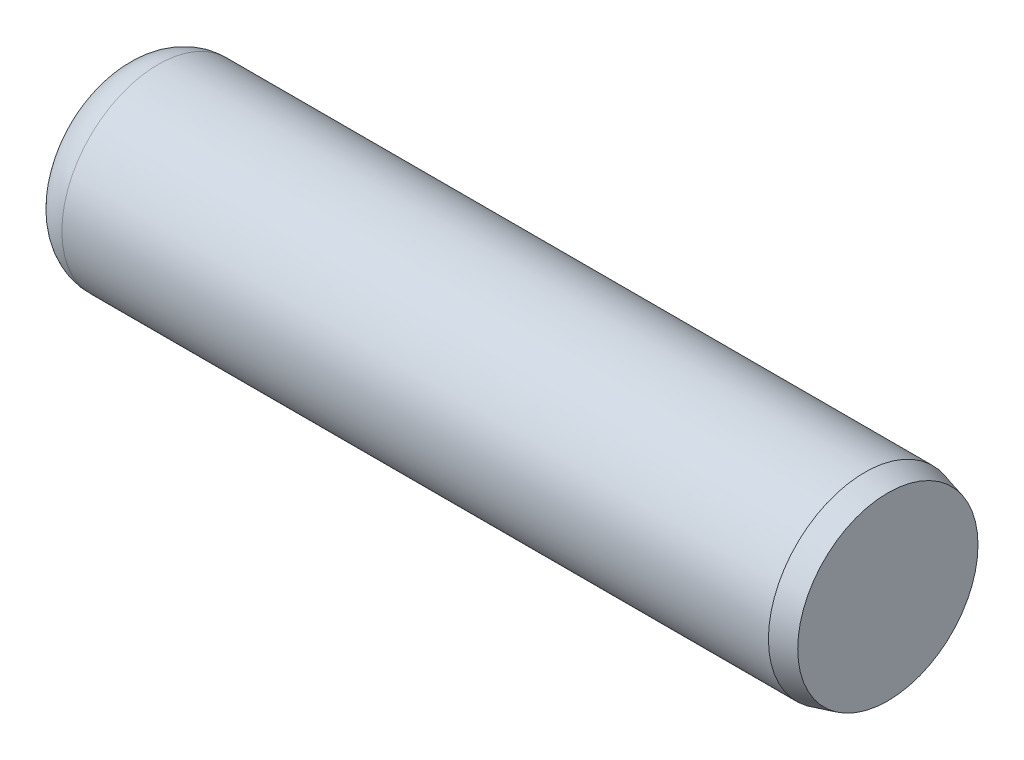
ISO-10303-21;
HEADER;
FILE_DESCRIPTION(('STEP AP214'),'2;1');
FILE_NAME('part.step','',(''),(''),'','','');
FILE_SCHEMA(('AUTOMOTIVE_DESIGN { 1 0 10303 214 1 1 1 1 }'));
ENDSEC;
DATA;
#1=APPLICATION_CONTEXT('core data for automotive mechanical design processes');
#2=APPLICATION_PROTOCOL_DEFINITION('international standard','automotive_design',2000,#1);
#3=PRODUCT_CONTEXT('',#1,'mechanical');
#4=PRODUCT('Part','Part','',(#3));
#5=PRODUCT_RELATED_PRODUCT_CATEGORY('part','',(#4));
#6=PRODUCT_DEFINITION_FORMATION('','',#4);
#7=PRODUCT_DEFINITION_CONTEXT('part definition',#1,'design');
#8=PRODUCT_DEFINITION('design','',#6,#7);
#9=PRODUCT_DEFINITION_SHAPE('','',#8);
#10=(LENGTH_UNIT() NAMED_UNIT(*) SI_UNIT(.MILLI.,.METRE.));
#11=(NAMED_UNIT(*) PLANE_ANGLE_UNIT() SI_UNIT($,.RADIAN.));
#12=(NAMED_UNIT(*) SI_UNIT($,.STERADIAN.) SOLID_ANGLE_UNIT());
#13=UNCERTAINTY_MEASURE_WITH_UNIT(LENGTH_MEASURE(1.E-05),#10,'distance_accuracy_value','');
#14=(GEOMETRIC_REPRESENTATION_CONTEXT(3) GLOBAL_UNCERTAINTY_ASSIGNED_CONTEXT((#13)) GLOBAL_UNIT_ASSIGNED_CONTEXT((#10,
#11,#12)) REPRESENTATION_CONTEXT('',''));
#15=CARTESIAN_POINT('',(0.,0.,0.));
#16=DIRECTION('',(0.,0.,1.));
#17=DIRECTION('',(1.,0.,0.));
#18=AXIS2_PLACEMENT_3D('',#15,#16,#17);
#19=CARTESIAN_POINT('',(0.,0.477773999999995,0.));
#20=DIRECTION('',(1.,0.,0.));
#21=DIRECTION('',(0.,0.,-1.));
#22=AXIS2_PLACEMENT_3D('',#19,#20,#21);
#23=PLANE('',#22);
#24=CARTESIAN_POINT('',(0.,0.,0.));
#25=DIRECTION('',(-1.,0.,0.));
#26=DIRECTION('',(0.,0.,1.));
#27=AXIS2_PLACEMENT_3D('',#24,#25,#26);
#28=CIRCLE('',#27,0.477773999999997);
#29=CARTESIAN_POINT('',(0.,0.,0.477773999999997));
#30=VERTEX_POINT('',#29);
#31=EDGE_CURVE('E55',#30,#30,#28,.T.);
#32=ORIENTED_EDGE('',*,*,#31,.T.);
#33=EDGE_LOOP('',(#32));
#34=FACE_BOUND('',#33,.T.);
#35=ADVANCED_FACE('F38',(#34),#23,.F.);
#36=CARTESIAN_POINT('',(6.35,0.,0.));
#37=DIRECTION('',(-1.,0.,0.));
#38=DIRECTION('',(0.,0.,1.));
#39=AXIS2_PLACEMENT_3D('',#36,#37,#38);
#40=PLANE('',#39);
#41=CARTESIAN_POINT('',(6.35,0.,0.));
#42=DIRECTION('',(-1.,0.,0.));
#43=DIRECTION('',(0.,0.,1.));
#44=AXIS2_PLACEMENT_3D('',#41,#42,#43);
#45=CIRCLE('',#44,0.745082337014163);
#46=CARTESIAN_POINT('',(6.35,0.,0.745082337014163));
#47=VERTEX_POINT('',#46);
#48=EDGE_CURVE('E10',#47,#47,#45,.T.);
#49=ORIENTED_EDGE('',*,*,#48,.F.);
#50=EDGE_LOOP('',(#49));
#51=FACE_BOUND('',#50,.T.);
#52=ADVANCED_FACE('F75',(#51),#40,.F.);
#53=CARTESIAN_POINT('',(6.35,0.,0.));
#54=DIRECTION('',(-1.,0.,0.));
#55=DIRECTION('',(0.,0.,1.));
#56=AXIS2_PLACEMENT_3D('',#53,#54,#55);
#57=CONICAL_SURFACE('',#56,0.745082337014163,0.261799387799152);
#58=CARTESIAN_POINT('',(6.1588904,0.,0.));
#59=DIRECTION('',(-1.,0.,0.));
#60=DIRECTION('',(0.,0.,1.));
#61=AXIS2_PLACEMENT_3D('',#58,#59,#60);
#62=CIRCLE('',#61,0.796289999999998);
#63=CARTESIAN_POINT('',(6.1588904,0.,0.796289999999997));
#64=VERTEX_POINT('',#63);
#65=EDGE_CURVE('E45',#64,#64,#62,.T.);
#66=ORIENTED_EDGE('',*,*,#65,.F.);
#67=EDGE_LOOP('',(#66));
#68=FACE_BOUND('',#67,.T.);
#69=ORIENTED_EDGE('',*,*,#48,.T.);
#70=EDGE_LOOP('',(#69));
#71=FACE_BOUND('',#70,.T.);
#72=ADVANCED_FACE('F71',(#68,#71),#57,.T.);
#73=CARTESIAN_POINT('',(-6.35,0.,0.));
#74=DIRECTION('',(-1.,0.,0.));
#75=DIRECTION('',(0.,0.,1.));
#76=AXIS2_PLACEMENT_3D('',#73,#74,#75);
#77=CYLINDRICAL_SURFACE('',#76,0.796289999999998);
#78=CARTESIAN_POINT('',(0.318515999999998,0.,0.));
#79=DIRECTION('',(-1.,0.,0.));
#80=DIRECTION('',(0.,0.,1.));
#81=AXIS2_PLACEMENT_3D('',#78,#79,#80);
#82=CIRCLE('',#81,0.796289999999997);
#83=CARTESIAN_POINT('',(0.318515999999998,0.,0.796289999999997));
#84=VERTEX_POINT('',#83);
#85=EDGE_CURVE('E51',#84,#84,#82,.T.);
#86=ORIENTED_EDGE('',*,*,#85,.F.);
#87=EDGE_LOOP('',(#86));
#88=FACE_BOUND('',#87,.T.);
#89=ORIENTED_EDGE('',*,*,#65,.T.);
#90=EDGE_LOOP('',(#89));
#91=FACE_BOUND('',#90,.T.);
#92=ADVANCED_FACE('F66',(#88,#91),#77,.T.);
#93=CARTESIAN_POINT('',(0.318515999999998,0.,0.));
#94=DIRECTION('',(-1.,0.,0.));
#95=DIRECTION('',(0.,0.,1.));
#96=AXIS2_PLACEMENT_3D('',#93,#94,#95);
#97=TOROIDAL_SURFACE('',#96,0.477773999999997,0.318516);
#98=ORIENTED_EDGE('',*,*,#31,.F.);
#99=EDGE_LOOP('',(#98));
#100=FACE_BOUND('',#99,.T.);
#101=ORIENTED_EDGE('',*,*,#85,.T.);
#102=EDGE_LOOP('',(#101));
#103=FACE_BOUND('',#102,.T.);
#104=ADVANCED_FACE('F63',(#100,#103),#97,.T.);
#105=CLOSED_SHELL('',(#35,#52,#72,#92,#104));
#106=MANIFOLD_SOLID_BREP('B2',#105);
#107=ADVANCED_BREP_SHAPE_REPRESENTATION('',(#18,#106),#14);
#108=SHAPE_DEFINITION_REPRESENTATION(#9,#107);
ENDSEC;
END-ISO-10303-21;
